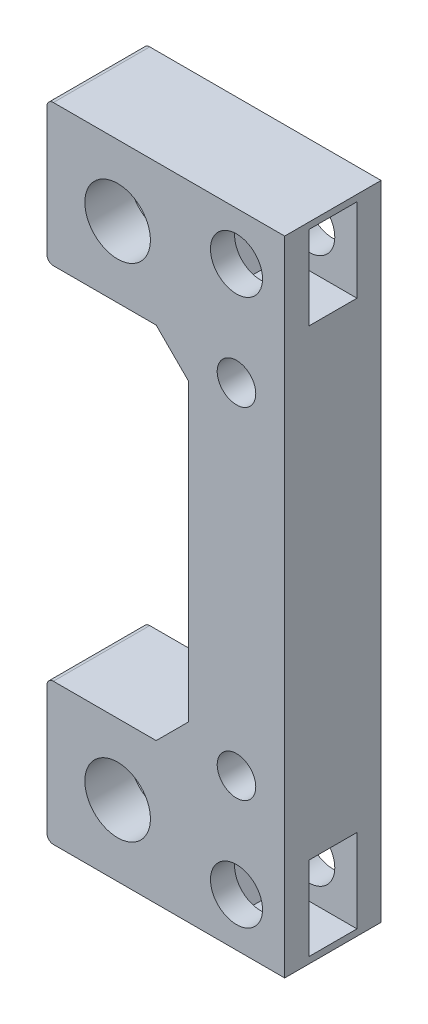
from build123d import *

# Parameters (mm, degrees)
ESQUISSE1_W              = 15
ESQUISSE1_H              = 100
BOSS_EXTRU_1_DEPTH       = 15
ESQUISSE2_R              = 3
ENL_V_MAT_EXTRU_2_DEPTH  = 37
ENL_V_MAT_EXTRU_6_DEPTH  = 10
ESQUISSE10_R             = 4.05
ENL_V_MAT_EXTRU_7_DEPTH  = 103.225241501
ENL_V_START              = -3.75
ENL_V_MAT_EXTRU_8_DEPTH  = 7.5
ESQUISSE12_W             = 22
ESQUISSE12_H             = 22
BOSS_EXTRU_2_DEPTH       = 15
ESQUISSE13_R             = 5.1
ENL_V_MAT_EXTRU_9_DEPTH  = 15
ENL_V_MAT_EXTRU_10_DEPTH = 8
CONG_1_R                 = 1
CHANFREIN1_SIZE          = 5


with BuildPart() as part:
    # Esquisse1 → Boss.-Extru.1 (new body)
    with BuildSketch(Plane.XY):
        with Locations((7.5, -50)):
            Rectangle(ESQUISSE1_W, ESQUISSE1_H)
    extrude(amount=BOSS_EXTRU_1_DEPTH)

    # Esquisse2 → Enl_v. mat.-Extru.2 (cut)
    with BuildSketch(Plane.XY.offset(15)):
        with Locations((7.5, -23.5)):
            Circle(ESQUISSE2_R)
        with Locations((7.5, -76.5)):
            Circle(ESQUISSE2_R)
    extrude(amount=-ENL_V_MAT_EXTRU_2_DEPTH, mode=Mode.SUBTRACT)

    # Esquisse8 → Enl_v. mat.-Extru.6 (cut)
    with BuildSketch(Plane(origin=(0, 0, 0), x_dir=(-1, 0, 0), z_dir=(0, 0, -1))):
        Polygon((-7.5, -70.726497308), (-12.5, -73.613248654), (-12.5, -79.386751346), (-7.5, -82.273502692), (-2.5, -79.386751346), (-2.5, -73.613248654), align=None)
        Polygon((-7.5, -17.726497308), (-12.5, -20.613248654), (-12.5, -26.386751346), (-7.5, -29.273502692), (-2.5, -26.386751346), (-2.5, -20.613248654), align=None)
    extrude(amount=-ENL_V_MAT_EXTRU_6_DEPTH, mode=Mode.SUBTRACT)

    # Esquisse10 → Enl_v. mat.-Extru.7 (cut, through all)
    with BuildSketch(Plane.XY.offset(15)):
        with Locations((7.5, -7.5)):
            Circle(ESQUISSE10_R)
        with Locations((7.5, -92.5)):
            Circle(ESQUISSE10_R)
    extrude(amount=-ENL_V_MAT_EXTRU_7_DEPTH, mode=Mode.SUBTRACT)

    # Esquisse11 → Enl_v. mat.-Extru.8 (cut)
    with BuildSketch(Plane.XY.offset(15).offset(ENL_V_START)):
        Polygon((3.74722325, -14), (15, -14), (15, -1), (3.74722325, -1), (-0.005553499, -7.5), align=None)
        Polygon((3.74722325, -86), (-0.005553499, -92.5), (3.74722325, -99), (15, -99), (15, -86), align=None)
    extrude(amount=-ENL_V_MAT_EXTRU_8_DEPTH, mode=Mode.SUBTRACT)

    # Esquisse12 → Boss.-Extru.2 (add)
    with BuildSketch(Plane(origin=(0, 0, 0), x_dir=(-1, 0, 0), z_dir=(0, 0, -1))):
        with Locations((11, -89)):
            Rectangle(ESQUISSE12_W, ESQUISSE12_H)
        with Locations((11, -11)):
            Rectangle(ESQUISSE12_W, ESQUISSE12_H)
    extrude(amount=-BOSS_EXTRU_2_DEPTH)

    # Esquisse13 → Enl_v. mat.-Extru.9 (cut)
    with BuildSketch(Plane(origin=(0, 0, 0), x_dir=(-1, 0, 0), z_dir=(0, 0, -1))):
        with Locations((11, -89)):
            Circle(ESQUISSE13_R)
        with Locations((11, -11)):
            Circle(ESQUISSE13_R)
    extrude(amount=-ENL_V_MAT_EXTRU_9_DEPTH, mode=Mode.SUBTRACT)

    # Esquisse14 → Enl_v. mat.-Extru.10 (cut)
    with BuildSketch(Plane(origin=(0, 0, 0), x_dir=(-1, 0, 0), z_dir=(0, 0, -1))):
        Polygon((11, -79.762395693), (3, -84.381197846), (3, -93.618802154), (11, -98.237604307), (19, -93.618802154), (19, -84.381197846), align=None)
        Polygon((19, -6.381197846), (11, -1.762395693), (3, -6.381197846), (3, -15.618802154), (11, -20.237604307), (19, -15.618802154), align=None)
    extrude(amount=-ENL_V_MAT_EXTRU_10_DEPTH, mode=Mode.SUBTRACT)

    # Cong_1
    cong_1_edges = [part.edges().sort_by_distance(p)[0] for p in [
        (-22, -78, 7.5),
        (-22, -100, 7.5),
        (-22, 0, 7.5),
        (-22, -22, 7.5),
    ]]
    fillet(cong_1_edges, radius=CONG_1_R)

    # Chanfrein1
    chanfrein1_edges = [part.edges().sort_by_distance(p)[0] for p in [
        (0, -78, 7.5),
        (0, -22, 7.5),
    ]]
    chamfer(chanfrein1_edges, length=CHANFREIN1_SIZE)


solid = part.part
